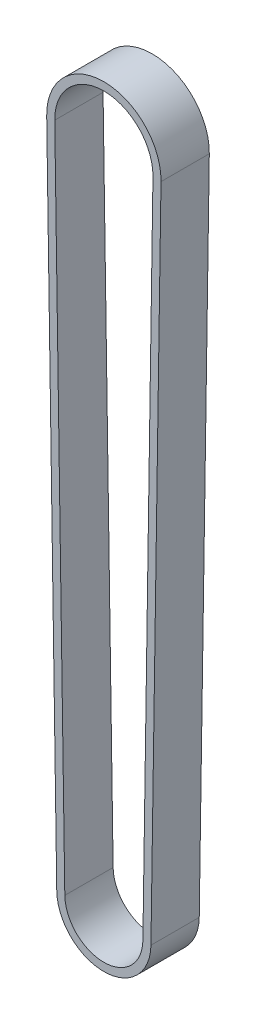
ISO-10303-21;
HEADER;
FILE_DESCRIPTION(('STEP AP214'),'2;1');
FILE_NAME('part.step','',(''),(''),'','','');
FILE_SCHEMA(('AUTOMOTIVE_DESIGN { 1 0 10303 214 1 1 1 1 }'));
ENDSEC;
DATA;
#1=APPLICATION_CONTEXT('core data for automotive mechanical design processes');
#2=APPLICATION_PROTOCOL_DEFINITION('international standard','automotive_design',2000,#1);
#3=PRODUCT_CONTEXT('',#1,'mechanical');
#4=PRODUCT('Part','Part','',(#3));
#5=PRODUCT_RELATED_PRODUCT_CATEGORY('part','',(#4));
#6=PRODUCT_DEFINITION_FORMATION('','',#4);
#7=PRODUCT_DEFINITION_CONTEXT('part definition',#1,'design');
#8=PRODUCT_DEFINITION('design','',#6,#7);
#9=PRODUCT_DEFINITION_SHAPE('','',#8);
#10=(LENGTH_UNIT() NAMED_UNIT(*) SI_UNIT(.MILLI.,.METRE.));
#11=(NAMED_UNIT(*) PLANE_ANGLE_UNIT() SI_UNIT($,.RADIAN.));
#12=(NAMED_UNIT(*) SI_UNIT($,.STERADIAN.) SOLID_ANGLE_UNIT());
#13=UNCERTAINTY_MEASURE_WITH_UNIT(LENGTH_MEASURE(1.E-05),#10,'distance_accuracy_value','');
#14=(GEOMETRIC_REPRESENTATION_CONTEXT(3) GLOBAL_UNCERTAINTY_ASSIGNED_CONTEXT((#13)) GLOBAL_UNIT_ASSIGNED_CONTEXT((#10,
#11,#12)) REPRESENTATION_CONTEXT('',''));
#15=CARTESIAN_POINT('',(0.,0.,0.));
#16=DIRECTION('',(0.,0.,1.));
#17=DIRECTION('',(1.,0.,0.));
#18=AXIS2_PLACEMENT_3D('',#15,#16,#17);
#19=CARTESIAN_POINT('',(0.,82.7903435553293,6.));
#20=DIRECTION('',(0.,0.,1.));
#21=DIRECTION('',(1.,0.,0.));
#22=AXIS2_PLACEMENT_3D('',#19,#20,#21);
#23=PLANE('',#22);
#24=CARTESIAN_POINT('',(0.,82.7903435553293,6.));
#25=DIRECTION('',(0.,0.,1.));
#26=DIRECTION('',(1.,0.,0.));
#27=AXIS2_PLACEMENT_3D('',#24,#25,#26);
#28=CIRCLE('',#27,7.1);
#29=CARTESIAN_POINT('',(7.09919069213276,82.6831450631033,6.));
#30=VERTEX_POINT('',#29);
#31=CARTESIAN_POINT('',(-7.09919069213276,82.6831450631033,6.));
#32=VERTEX_POINT('',#31);
#33=EDGE_CURVE('E135',#30,#32,#28,.T.);
#34=ORIENTED_EDGE('',*,*,#33,.T.);
#35=DIRECTION('',(0.0150983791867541,-0.999886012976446,0.));
#36=VECTOR('',#35,1.);
#37=CARTESIAN_POINT('',(-7.09919069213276,82.6831450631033,6.));
#38=LINE('',#37,#36);
#39=CARTESIAN_POINT('',(-5.84933317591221,-0.0883255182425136,6.));
#40=VERTEX_POINT('',#39);
#41=EDGE_CURVE('E138',#32,#40,#38,.T.);
#42=ORIENTED_EDGE('',*,*,#41,.T.);
#43=CARTESIAN_POINT('',(0.,0.,6.));
#44=DIRECTION('',(0.,0.,1.));
#45=DIRECTION('',(1.,0.,0.));
#46=AXIS2_PLACEMENT_3D('',#43,#44,#45);
#47=CIRCLE('',#46,5.85);
#48=CARTESIAN_POINT('',(5.84933317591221,-0.0883255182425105,6.));
#49=VERTEX_POINT('',#48);
#50=EDGE_CURVE('E141',#40,#49,#47,.T.);
#51=ORIENTED_EDGE('',*,*,#50,.T.);
#52=DIRECTION('',(0.015098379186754,0.999886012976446,0.));
#53=VECTOR('',#52,1.);
#54=CARTESIAN_POINT('',(7.09919069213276,82.6831450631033,6.));
#55=LINE('',#54,#53);
#56=EDGE_CURVE('E143',#49,#30,#55,.T.);
#57=ORIENTED_EDGE('',*,*,#56,.T.);
#58=EDGE_LOOP('',(#34,#42,#51,#57));
#59=FACE_BOUND('',#58,.T.);
#60=DIRECTION('',(0.0150983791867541,-0.999886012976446,0.));
#61=VECTOR('',#60,1.);
#62=CARTESIAN_POINT('',(-6.09930467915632,82.6982434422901,6.));
#63=LINE('',#62,#61);
#64=CARTESIAN_POINT('',(-6.09930467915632,82.6982434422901,6.));
#65=VERTEX_POINT('',#64);
#66=CARTESIAN_POINT('',(-4.84944716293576,-0.073227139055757,6.));
#67=VERTEX_POINT('',#66);
#68=EDGE_CURVE('E107',#65,#67,#63,.T.);
#69=ORIENTED_EDGE('',*,*,#68,.F.);
#70=CARTESIAN_POINT('',(0.,82.7903435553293,6.));
#71=DIRECTION('',(0.,0.,1.));
#72=DIRECTION('',(1.,0.,0.));
#73=AXIS2_PLACEMENT_3D('',#70,#71,#72);
#74=CIRCLE('',#73,6.1);
#75=CARTESIAN_POINT('',(6.09930467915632,82.6982434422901,6.));
#76=VERTEX_POINT('',#75);
#77=EDGE_CURVE('E99',#76,#65,#74,.T.);
#78=ORIENTED_EDGE('',*,*,#77,.F.);
#79=DIRECTION('',(0.015098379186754,0.999886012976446,0.));
#80=VECTOR('',#79,1.);
#81=CARTESIAN_POINT('',(6.09930467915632,82.6982434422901,6.));
#82=LINE('',#81,#80);
#83=CARTESIAN_POINT('',(4.84944716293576,-0.0732271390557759,6.));
#84=VERTEX_POINT('',#83);
#85=EDGE_CURVE('E121',#84,#76,#82,.T.);
#86=ORIENTED_EDGE('',*,*,#85,.F.);
#87=CARTESIAN_POINT('',(0.,0.,6.));
#88=DIRECTION('',(0.,0.,1.));
#89=DIRECTION('',(1.,0.,0.));
#90=AXIS2_PLACEMENT_3D('',#87,#88,#89);
#91=CIRCLE('',#90,4.85);
#92=EDGE_CURVE('E119',#67,#84,#91,.T.);
#93=ORIENTED_EDGE('',*,*,#92,.F.);
#94=EDGE_LOOP('',(#69,#78,#86,#93));
#95=FACE_BOUND('',#94,.T.);
#96=ADVANCED_FACE('F34',(#59,#95),#23,.T.);
#97=CARTESIAN_POINT('',(0.,82.7903435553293,0.));
#98=DIRECTION('',(0.,0.,1.));
#99=DIRECTION('',(1.,0.,0.));
#100=AXIS2_PLACEMENT_3D('',#97,#98,#99);
#101=PLANE('',#100);
#102=CARTESIAN_POINT('',(0.,82.7903435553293,0.));
#103=DIRECTION('',(0.,0.,1.));
#104=DIRECTION('',(1.,0.,0.));
#105=AXIS2_PLACEMENT_3D('',#102,#103,#104);
#106=CIRCLE('',#105,7.1);
#107=CARTESIAN_POINT('',(7.09919069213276,82.6831450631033,0.));
#108=VERTEX_POINT('',#107);
#109=CARTESIAN_POINT('',(-7.09919069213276,82.6831450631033,0.));
#110=VERTEX_POINT('',#109);
#111=EDGE_CURVE('E115',#108,#110,#106,.T.);
#112=ORIENTED_EDGE('',*,*,#111,.F.);
#113=DIRECTION('',(0.015098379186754,0.999886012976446,0.));
#114=VECTOR('',#113,1.);
#115=CARTESIAN_POINT('',(7.09919069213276,82.6831450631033,0.));
#116=LINE('',#115,#114);
#117=CARTESIAN_POINT('',(5.84933317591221,-0.0883255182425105,0.));
#118=VERTEX_POINT('',#117);
#119=EDGE_CURVE('E139',#118,#108,#116,.T.);
#120=ORIENTED_EDGE('',*,*,#119,.F.);
#121=CARTESIAN_POINT('',(0.,0.,0.));
#122=DIRECTION('',(0.,0.,1.));
#123=DIRECTION('',(1.,0.,0.));
#124=AXIS2_PLACEMENT_3D('',#121,#122,#123);
#125=CIRCLE('',#124,5.85);
#126=CARTESIAN_POINT('',(-5.84933317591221,-0.0883255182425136,0.));
#127=VERTEX_POINT('',#126);
#128=EDGE_CURVE('E150',#127,#118,#125,.T.);
#129=ORIENTED_EDGE('',*,*,#128,.F.);
#130=DIRECTION('',(0.0150983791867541,-0.999886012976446,0.));
#131=VECTOR('',#130,1.);
#132=CARTESIAN_POINT('',(-7.09919069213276,82.6831450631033,0.));
#133=LINE('',#132,#131);
#134=EDGE_CURVE('E148',#110,#127,#133,.T.);
#135=ORIENTED_EDGE('',*,*,#134,.F.);
#136=EDGE_LOOP('',(#112,#120,#129,#135));
#137=FACE_BOUND('',#136,.T.);
#138=CARTESIAN_POINT('',(0.,82.7903435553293,0.));
#139=DIRECTION('',(0.,0.,1.));
#140=DIRECTION('',(1.,0.,0.));
#141=AXIS2_PLACEMENT_3D('',#138,#139,#140);
#142=CIRCLE('',#141,6.1);
#143=CARTESIAN_POINT('',(6.09930467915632,82.6982434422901,0.));
#144=VERTEX_POINT('',#143);
#145=CARTESIAN_POINT('',(-6.09930467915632,82.6982434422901,0.));
#146=VERTEX_POINT('',#145);
#147=EDGE_CURVE('E57',#144,#146,#142,.T.);
#148=ORIENTED_EDGE('',*,*,#147,.T.);
#149=DIRECTION('',(0.0150983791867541,-0.999886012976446,0.));
#150=VECTOR('',#149,1.);
#151=CARTESIAN_POINT('',(-6.09930467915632,82.6982434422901,0.));
#152=LINE('',#151,#150);
#153=CARTESIAN_POINT('',(-4.84944716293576,-0.073227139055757,0.));
#154=VERTEX_POINT('',#153);
#155=EDGE_CURVE('E114',#146,#154,#152,.T.);
#156=ORIENTED_EDGE('',*,*,#155,.T.);
#157=CARTESIAN_POINT('',(0.,0.,0.));
#158=DIRECTION('',(0.,0.,1.));
#159=DIRECTION('',(1.,0.,0.));
#160=AXIS2_PLACEMENT_3D('',#157,#158,#159);
#161=CIRCLE('',#160,4.85);
#162=CARTESIAN_POINT('',(4.84944716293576,-0.0732271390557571,0.));
#163=VERTEX_POINT('',#162);
#164=EDGE_CURVE('E127',#154,#163,#161,.T.);
#165=ORIENTED_EDGE('',*,*,#164,.T.);
#166=DIRECTION('',(0.015098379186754,0.999886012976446,0.));
#167=VECTOR('',#166,1.);
#168=CARTESIAN_POINT('',(6.09930467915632,82.6982434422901,0.));
#169=LINE('',#168,#167);
#170=EDGE_CURVE('E108',#163,#144,#169,.T.);
#171=ORIENTED_EDGE('',*,*,#170,.T.);
#172=EDGE_LOOP('',(#148,#156,#165,#171));
#173=FACE_BOUND('',#172,.T.);
#174=ADVANCED_FACE('F168',(#137,#173),#101,.F.);
#175=CARTESIAN_POINT('',(0.,82.7903435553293,6.));
#176=DIRECTION('',(0.,0.,-1.));
#177=DIRECTION('',(-1.,0.,0.));
#178=AXIS2_PLACEMENT_3D('',#175,#176,#177);
#179=CYLINDRICAL_SURFACE('',#178,7.1);
#180=ORIENTED_EDGE('',*,*,#111,.T.);
#181=DIRECTION('',(0.,0.,-1.));
#182=VECTOR('',#181,1.);
#183=CARTESIAN_POINT('',(-7.09919069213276,82.6831450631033,6.));
#184=LINE('',#183,#182);
#185=EDGE_CURVE('E11',#32,#110,#184,.T.);
#186=ORIENTED_EDGE('',*,*,#185,.F.);
#187=ORIENTED_EDGE('',*,*,#33,.F.);
#188=DIRECTION('',(0.,0.,-1.));
#189=VECTOR('',#188,1.);
#190=CARTESIAN_POINT('',(7.09919069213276,82.6831450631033,6.));
#191=LINE('',#190,#189);
#192=EDGE_CURVE('E145',#30,#108,#191,.T.);
#193=ORIENTED_EDGE('',*,*,#192,.T.);
#194=EDGE_LOOP('',(#180,#186,#187,#193));
#195=FACE_BOUND('',#194,.T.);
#196=ADVANCED_FACE('F36',(#195),#179,.T.);
#197=CARTESIAN_POINT('',(-7.09919069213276,82.6831450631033,6.));
#198=DIRECTION('',(0.999886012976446,0.0150983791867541,0.));
#199=DIRECTION('',(-0.0150983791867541,0.999886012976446,0.));
#200=AXIS2_PLACEMENT_3D('',#197,#198,#199);
#201=PLANE('',#200);
#202=ORIENTED_EDGE('',*,*,#134,.T.);
#203=DIRECTION('',(0.,0.,-1.));
#204=VECTOR('',#203,1.);
#205=CARTESIAN_POINT('',(-5.84933317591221,-0.0883255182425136,6.));
#206=LINE('',#205,#204);
#207=EDGE_CURVE('E42',#40,#127,#206,.T.);
#208=ORIENTED_EDGE('',*,*,#207,.F.);
#209=ORIENTED_EDGE('',*,*,#41,.F.);
#210=ORIENTED_EDGE('',*,*,#185,.T.);
#211=EDGE_LOOP('',(#202,#208,#209,#210));
#212=FACE_BOUND('',#211,.T.);
#213=ADVANCED_FACE('F178',(#212),#201,.F.);
#214=CARTESIAN_POINT('',(0.,0.,6.));
#215=DIRECTION('',(0.,0.,-1.));
#216=DIRECTION('',(-1.,0.,0.));
#217=AXIS2_PLACEMENT_3D('',#214,#215,#216);
#218=CYLINDRICAL_SURFACE('',#217,5.85);
#219=ORIENTED_EDGE('',*,*,#128,.T.);
#220=DIRECTION('',(0.,0.,-1.));
#221=VECTOR('',#220,1.);
#222=CARTESIAN_POINT('',(5.84933317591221,-0.0883255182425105,6.));
#223=LINE('',#222,#221);
#224=EDGE_CURVE('E155',#49,#118,#223,.T.);
#225=ORIENTED_EDGE('',*,*,#224,.F.);
#226=ORIENTED_EDGE('',*,*,#50,.F.);
#227=ORIENTED_EDGE('',*,*,#207,.T.);
#228=EDGE_LOOP('',(#219,#225,#226,#227));
#229=FACE_BOUND('',#228,.T.);
#230=ADVANCED_FACE('F162',(#229),#218,.T.);
#231=CARTESIAN_POINT('',(7.09919069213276,82.6831450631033,6.));
#232=DIRECTION('',(-0.999886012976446,0.015098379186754,0.));
#233=DIRECTION('',(-0.015098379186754,-0.999886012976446,0.));
#234=AXIS2_PLACEMENT_3D('',#231,#232,#233);
#235=PLANE('',#234);
#236=ORIENTED_EDGE('',*,*,#119,.T.);
#237=ORIENTED_EDGE('',*,*,#192,.F.);
#238=ORIENTED_EDGE('',*,*,#56,.F.);
#239=ORIENTED_EDGE('',*,*,#224,.T.);
#240=EDGE_LOOP('',(#236,#237,#238,#239));
#241=FACE_BOUND('',#240,.T.);
#242=ADVANCED_FACE('F172',(#241),#235,.F.);
#243=CARTESIAN_POINT('',(0.,82.7903435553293,6.));
#244=DIRECTION('',(0.,0.,-1.));
#245=DIRECTION('',(-1.,0.,0.));
#246=AXIS2_PLACEMENT_3D('',#243,#244,#245);
#247=CYLINDRICAL_SURFACE('',#246,6.1);
#248=ORIENTED_EDGE('',*,*,#147,.F.);
#249=DIRECTION('',(0.,0.,-1.));
#250=VECTOR('',#249,1.);
#251=CARTESIAN_POINT('',(6.09930467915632,82.6982434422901,6.));
#252=LINE('',#251,#250);
#253=EDGE_CURVE('E103',#76,#144,#252,.T.);
#254=ORIENTED_EDGE('',*,*,#253,.F.);
#255=ORIENTED_EDGE('',*,*,#77,.T.);
#256=DIRECTION('',(0.,0.,-1.));
#257=VECTOR('',#256,1.);
#258=CARTESIAN_POINT('',(-6.09930467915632,82.6982434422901,6.));
#259=LINE('',#258,#257);
#260=EDGE_CURVE('E102',#65,#146,#259,.T.);
#261=ORIENTED_EDGE('',*,*,#260,.T.);
#262=EDGE_LOOP('',(#248,#254,#255,#261));
#263=FACE_BOUND('',#262,.T.);
#264=ADVANCED_FACE('F101',(#263),#247,.F.);
#265=CARTESIAN_POINT('',(-6.09930467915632,82.6982434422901,6.));
#266=DIRECTION('',(0.999886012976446,0.0150983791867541,0.));
#267=DIRECTION('',(-0.0150983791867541,0.999886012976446,0.));
#268=AXIS2_PLACEMENT_3D('',#265,#266,#267);
#269=PLANE('',#268);
#270=ORIENTED_EDGE('',*,*,#155,.F.);
#271=ORIENTED_EDGE('',*,*,#260,.F.);
#272=ORIENTED_EDGE('',*,*,#68,.T.);
#273=DIRECTION('',(0.,0.,-1.));
#274=VECTOR('',#273,1.);
#275=CARTESIAN_POINT('',(-4.84944716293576,-0.073227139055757,6.));
#276=LINE('',#275,#274);
#277=EDGE_CURVE('E116',#67,#154,#276,.T.);
#278=ORIENTED_EDGE('',*,*,#277,.T.);
#279=EDGE_LOOP('',(#270,#271,#272,#278));
#280=FACE_BOUND('',#279,.T.);
#281=ADVANCED_FACE('F111',(#280),#269,.T.);
#282=CARTESIAN_POINT('',(0.,0.,6.));
#283=DIRECTION('',(0.,0.,-1.));
#284=DIRECTION('',(-1.,0.,0.));
#285=AXIS2_PLACEMENT_3D('',#282,#283,#284);
#286=CYLINDRICAL_SURFACE('',#285,4.85);
#287=ORIENTED_EDGE('',*,*,#164,.F.);
#288=ORIENTED_EDGE('',*,*,#277,.F.);
#289=ORIENTED_EDGE('',*,*,#92,.T.);
#290=DIRECTION('',(0.,0.,-1.));
#291=VECTOR('',#290,1.);
#292=CARTESIAN_POINT('',(4.84944716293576,-0.0732271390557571,6.));
#293=LINE('',#292,#291);
#294=EDGE_CURVE('E49',#84,#163,#293,.T.);
#295=ORIENTED_EDGE('',*,*,#294,.T.);
#296=EDGE_LOOP('',(#287,#288,#289,#295));
#297=FACE_BOUND('',#296,.T.);
#298=ADVANCED_FACE('F201',(#297),#286,.F.);
#299=CARTESIAN_POINT('',(6.09930467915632,82.6982434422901,6.));
#300=DIRECTION('',(-0.999886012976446,0.015098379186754,0.));
#301=DIRECTION('',(-0.015098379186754,-0.999886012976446,0.));
#302=AXIS2_PLACEMENT_3D('',#299,#300,#301);
#303=PLANE('',#302);
#304=ORIENTED_EDGE('',*,*,#170,.F.);
#305=ORIENTED_EDGE('',*,*,#294,.F.);
#306=ORIENTED_EDGE('',*,*,#85,.T.);
#307=ORIENTED_EDGE('',*,*,#253,.T.);
#308=EDGE_LOOP('',(#304,#305,#306,#307));
#309=FACE_BOUND('',#308,.T.);
#310=ADVANCED_FACE('F205',(#309),#303,.T.);
#311=CLOSED_SHELL('',(#96,#174,#196,#213,#230,#242,#264,#281,#298,#310));
#312=MANIFOLD_SOLID_BREP('B2',#311);
#313=ADVANCED_BREP_SHAPE_REPRESENTATION('',(#18,#312),#14);
#314=SHAPE_DEFINITION_REPRESENTATION(#9,#313);
ENDSEC;
END-ISO-10303-21;
